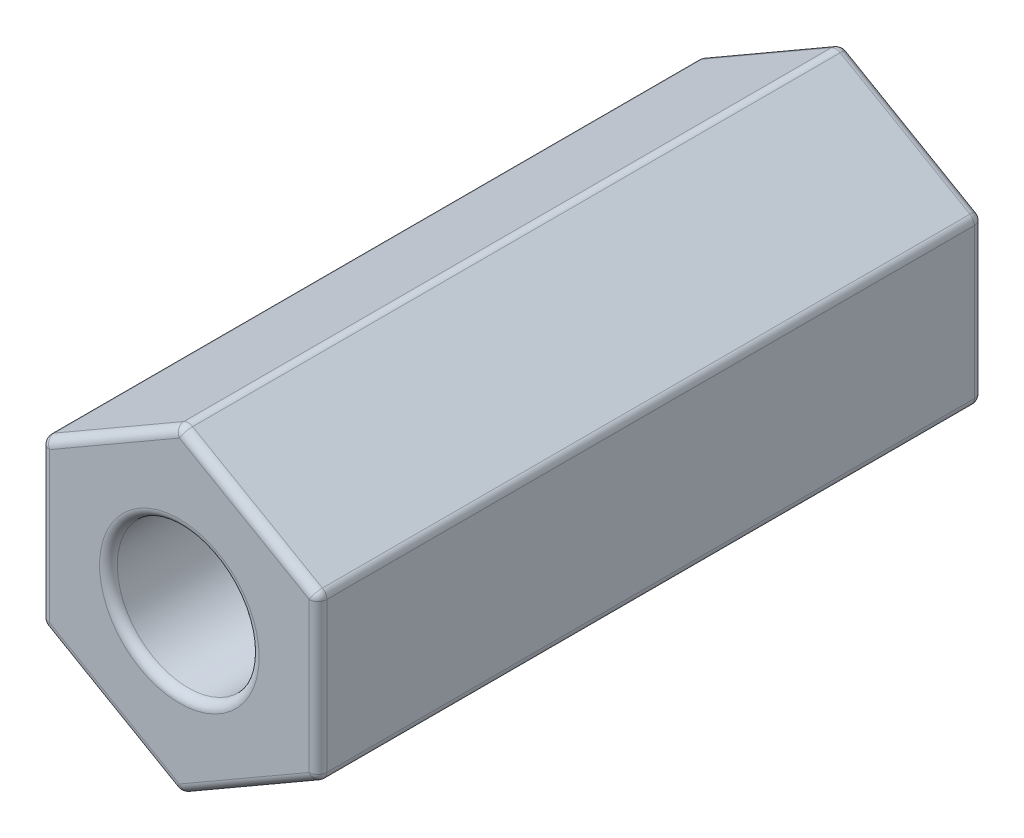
from build123d import *

# Parameters (mm, degrees)
SKETCH1_R      = 2.032
EXTRUDE1_DEPTH = 19.05
FILLET1_R      = 0.254


with BuildPart() as part:
    # Sketch1 → Extrude1 (new body)
    with BuildSketch(Plane.XY):
        Polygon((0, 4.582717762), (-3.96875, 2.291358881), (-3.96875, -2.291358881), (0, -4.582717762), (3.96875, -2.291358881), (3.96875, 2.291358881), align=None)
        Circle(SKETCH1_R, mode=Mode.SUBTRACT)
    extrude(amount=-EXTRUDE1_DEPTH)

    # Fillet1
    fillet1_edges = [part.edges().sort_by_distance(p)[0] for p in [
        (-3.96875, 0, -19.05),
        (0, -4.582717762, -9.525),
        (-3.96875, -2.291358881, -9.525),
        (-3.96875, 2.291358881, -9.525),
        (0, 4.582717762, -9.525),
        (-1.984375, -3.437038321, -19.05),
        (-2.032, 0, -19.05),
        (1.984375, -3.437038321, -19.05),
        (-2.032, 0, 0),
        (3.96875, 0, -19.05),
        (1.984375, 3.437038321, -19.05),
        (3.96875, 0, 0),
        (1.984375, -3.437038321, 0),
        (-1.984375, -3.437038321, 0),
        (-3.96875, 0, 0),
        (-1.984375, 3.437038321, -19.05),
        (-1.984375, 3.437038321, 0),
        (1.984375, 3.437038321, 0),
        (3.96875, 2.291358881, -9.525),
        (3.96875, -2.291358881, -9.525),
    ]]
    fillet(fillet1_edges, radius=FILLET1_R)


solid = part.part
